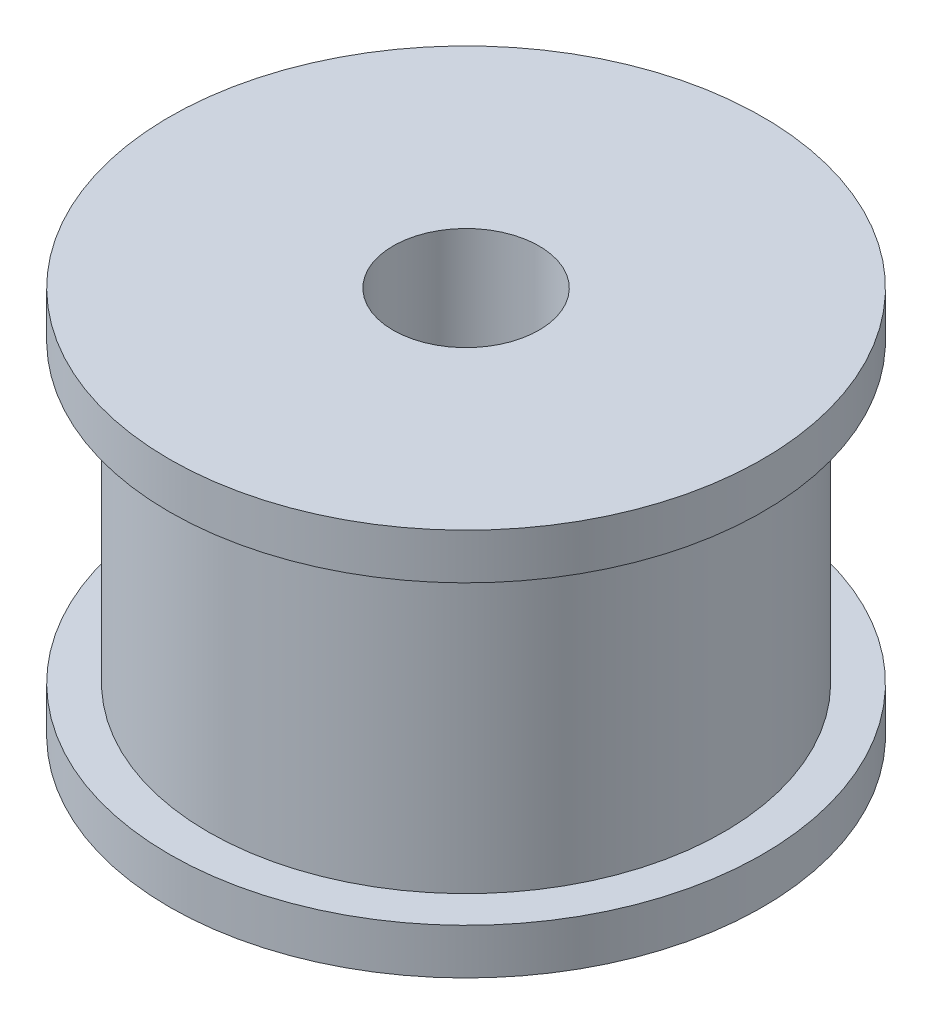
ISO-10303-21;
HEADER;
FILE_DESCRIPTION(('STEP AP214'),'2;1');
FILE_NAME('part.step','',(''),(''),'','','');
FILE_SCHEMA(('AUTOMOTIVE_DESIGN { 1 0 10303 214 1 1 1 1 }'));
ENDSEC;
DATA;
#1=APPLICATION_CONTEXT('core data for automotive mechanical design processes');
#2=APPLICATION_PROTOCOL_DEFINITION('international standard','automotive_design',2000,#1);
#3=PRODUCT_CONTEXT('',#1,'mechanical');
#4=PRODUCT('Part','Part','',(#3));
#5=PRODUCT_RELATED_PRODUCT_CATEGORY('part','',(#4));
#6=PRODUCT_DEFINITION_FORMATION('','',#4);
#7=PRODUCT_DEFINITION_CONTEXT('part definition',#1,'design');
#8=PRODUCT_DEFINITION('design','',#6,#7);
#9=PRODUCT_DEFINITION_SHAPE('','',#8);
#10=(LENGTH_UNIT() NAMED_UNIT(*) SI_UNIT(.MILLI.,.METRE.));
#11=(NAMED_UNIT(*) PLANE_ANGLE_UNIT() SI_UNIT($,.RADIAN.));
#12=(NAMED_UNIT(*) SI_UNIT($,.STERADIAN.) SOLID_ANGLE_UNIT());
#13=UNCERTAINTY_MEASURE_WITH_UNIT(LENGTH_MEASURE(1.E-05),#10,'distance_accuracy_value','');
#14=(GEOMETRIC_REPRESENTATION_CONTEXT(3) GLOBAL_UNCERTAINTY_ASSIGNED_CONTEXT((#13)) GLOBAL_UNIT_ASSIGNED_CONTEXT((#10,
#11,#12)) REPRESENTATION_CONTEXT('',''));
#15=CARTESIAN_POINT('',(0.,0.,0.));
#16=DIRECTION('',(0.,0.,1.));
#17=DIRECTION('',(1.,0.,0.));
#18=AXIS2_PLACEMENT_3D('',#15,#16,#17);
#19=CARTESIAN_POINT('',(-5.65,3.25,0.));
#20=DIRECTION('',(0.,-1.,0.));
#21=DIRECTION('',(0.,0.,-1.));
#22=AXIS2_PLACEMENT_3D('',#19,#20,#21);
#23=PLANE('',#22);
#24=CARTESIAN_POINT('',(0.,3.25,0.));
#25=DIRECTION('',(0.,1.,0.));
#26=DIRECTION('',(0.,0.,1.));
#27=AXIS2_PLACEMENT_3D('',#24,#25,#26);
#28=CIRCLE('',#27,5.65);
#29=CARTESIAN_POINT('',(0.,3.25,5.65));
#30=VERTEX_POINT('',#29);
#31=EDGE_CURVE('E54',#30,#30,#28,.T.);
#32=ORIENTED_EDGE('',*,*,#31,.T.);
#33=EDGE_LOOP('',(#32));
#34=FACE_BOUND('',#33,.T.);
#35=CARTESIAN_POINT('',(0.,3.25,0.));
#36=DIRECTION('',(0.,1.,0.));
#37=DIRECTION('',(0.,0.,1.));
#38=AXIS2_PLACEMENT_3D('',#35,#36,#37);
#39=CIRCLE('',#38,6.5);
#40=CARTESIAN_POINT('',(0.,3.25,6.5));
#41=VERTEX_POINT('',#40);
#42=EDGE_CURVE('E10',#41,#41,#39,.T.);
#43=ORIENTED_EDGE('',*,*,#42,.F.);
#44=EDGE_LOOP('',(#43));
#45=FACE_BOUND('',#44,.T.);
#46=ADVANCED_FACE('F32',(#34,#45),#23,.T.);
#47=CARTESIAN_POINT('',(0.,50.,0.));
#48=DIRECTION('',(0.,1.,0.));
#49=DIRECTION('',(0.,0.,1.));
#50=AXIS2_PLACEMENT_3D('',#47,#48,#49);
#51=CYLINDRICAL_SURFACE('',#50,6.5);
#52=ORIENTED_EDGE('',*,*,#42,.T.);
#53=EDGE_LOOP('',(#52));
#54=FACE_BOUND('',#53,.T.);
#55=CARTESIAN_POINT('',(0.,4.25,0.));
#56=DIRECTION('',(0.,1.,0.));
#57=DIRECTION('',(0.,0.,1.));
#58=AXIS2_PLACEMENT_3D('',#55,#56,#57);
#59=CIRCLE('',#58,6.5);
#60=CARTESIAN_POINT('',(0.,4.25,6.5));
#61=VERTEX_POINT('',#60);
#62=EDGE_CURVE('E39',#61,#61,#59,.T.);
#63=ORIENTED_EDGE('',*,*,#62,.F.);
#64=EDGE_LOOP('',(#63));
#65=FACE_BOUND('',#64,.T.);
#66=ADVANCED_FACE('F93',(#54,#65),#51,.T.);
#67=CARTESIAN_POINT('',(-6.5,4.25,0.));
#68=DIRECTION('',(0.,1.,0.));
#69=DIRECTION('',(0.,0.,1.));
#70=AXIS2_PLACEMENT_3D('',#67,#68,#69);
#71=PLANE('',#70);
#72=CARTESIAN_POINT('',(0.,4.25,0.));
#73=DIRECTION('',(0.,1.,0.));
#74=DIRECTION('',(0.,0.,1.));
#75=AXIS2_PLACEMENT_3D('',#72,#73,#74);
#76=CIRCLE('',#75,1.6);
#77=CARTESIAN_POINT('',(0.,4.25,1.6));
#78=VERTEX_POINT('',#77);
#79=EDGE_CURVE('E57',#78,#78,#76,.T.);
#80=ORIENTED_EDGE('',*,*,#79,.F.);
#81=EDGE_LOOP('',(#80));
#82=FACE_BOUND('',#81,.T.);
#83=ORIENTED_EDGE('',*,*,#62,.T.);
#84=EDGE_LOOP('',(#83));
#85=FACE_BOUND('',#84,.T.);
#86=ADVANCED_FACE('F70',(#82,#85),#71,.T.);
#87=CARTESIAN_POINT('',(-6.5,-4.25,0.));
#88=DIRECTION('',(0.,-1.,0.));
#89=DIRECTION('',(0.,0.,-1.));
#90=AXIS2_PLACEMENT_3D('',#87,#88,#89);
#91=PLANE('',#90);
#92=CARTESIAN_POINT('',(0.,-4.25,0.));
#93=DIRECTION('',(0.,-1.,0.));
#94=DIRECTION('',(0.,0.,-1.));
#95=AXIS2_PLACEMENT_3D('',#92,#93,#94);
#96=CIRCLE('',#95,1.6);
#97=CARTESIAN_POINT('',(0.,-4.25,-1.6));
#98=VERTEX_POINT('',#97);
#99=EDGE_CURVE('E35',#98,#98,#96,.T.);
#100=ORIENTED_EDGE('',*,*,#99,.F.);
#101=EDGE_LOOP('',(#100));
#102=FACE_BOUND('',#101,.T.);
#103=CARTESIAN_POINT('',(0.,-4.25,0.));
#104=DIRECTION('',(0.,1.,0.));
#105=DIRECTION('',(0.,0.,1.));
#106=AXIS2_PLACEMENT_3D('',#103,#104,#105);
#107=CIRCLE('',#106,6.5);
#108=CARTESIAN_POINT('',(0.,-4.25,6.5));
#109=VERTEX_POINT('',#108);
#110=EDGE_CURVE('E43',#109,#109,#107,.T.);
#111=ORIENTED_EDGE('',*,*,#110,.F.);
#112=EDGE_LOOP('',(#111));
#113=FACE_BOUND('',#112,.T.);
#114=ADVANCED_FACE('F66',(#102,#113),#91,.T.);
#115=CARTESIAN_POINT('',(0.,50.,0.));
#116=DIRECTION('',(0.,1.,0.));
#117=DIRECTION('',(0.,0.,1.));
#118=AXIS2_PLACEMENT_3D('',#115,#116,#117);
#119=CYLINDRICAL_SURFACE('',#118,6.5);
#120=ORIENTED_EDGE('',*,*,#110,.T.);
#121=EDGE_LOOP('',(#120));
#122=FACE_BOUND('',#121,.T.);
#123=CARTESIAN_POINT('',(0.,-3.25,0.));
#124=DIRECTION('',(0.,1.,0.));
#125=DIRECTION('',(0.,0.,1.));
#126=AXIS2_PLACEMENT_3D('',#123,#124,#125);
#127=CIRCLE('',#126,6.5);
#128=CARTESIAN_POINT('',(0.,-3.25,6.5));
#129=VERTEX_POINT('',#128);
#130=EDGE_CURVE('E48',#129,#129,#127,.T.);
#131=ORIENTED_EDGE('',*,*,#130,.F.);
#132=EDGE_LOOP('',(#131));
#133=FACE_BOUND('',#132,.T.);
#134=ADVANCED_FACE('F69',(#122,#133),#119,.T.);
#135=CARTESIAN_POINT('',(-5.65,-3.25,0.));
#136=DIRECTION('',(0.,1.,0.));
#137=DIRECTION('',(0.,0.,1.));
#138=AXIS2_PLACEMENT_3D('',#135,#136,#137);
#139=PLANE('',#138);
#140=ORIENTED_EDGE('',*,*,#130,.T.);
#141=EDGE_LOOP('',(#140));
#142=FACE_BOUND('',#141,.T.);
#143=CARTESIAN_POINT('',(0.,-3.25,0.));
#144=DIRECTION('',(0.,1.,0.));
#145=DIRECTION('',(0.,0.,1.));
#146=AXIS2_PLACEMENT_3D('',#143,#144,#145);
#147=CIRCLE('',#146,5.65);
#148=CARTESIAN_POINT('',(0.,-3.25,5.65));
#149=VERTEX_POINT('',#148);
#150=EDGE_CURVE('E51',#149,#149,#147,.T.);
#151=ORIENTED_EDGE('',*,*,#150,.F.);
#152=EDGE_LOOP('',(#151));
#153=FACE_BOUND('',#152,.T.);
#154=ADVANCED_FACE('F76',(#142,#153),#139,.T.);
#155=CARTESIAN_POINT('',(0.,50.,0.));
#156=DIRECTION('',(0.,1.,0.));
#157=DIRECTION('',(0.,0.,1.));
#158=AXIS2_PLACEMENT_3D('',#155,#156,#157);
#159=CYLINDRICAL_SURFACE('',#158,5.65);
#160=ORIENTED_EDGE('',*,*,#150,.T.);
#161=EDGE_LOOP('',(#160));
#162=FACE_BOUND('',#161,.T.);
#163=ORIENTED_EDGE('',*,*,#31,.F.);
#164=EDGE_LOOP('',(#163));
#165=FACE_BOUND('',#164,.T.);
#166=ADVANCED_FACE('F82',(#162,#165),#159,.T.);
#167=CARTESIAN_POINT('',(0.,-5.75,0.));
#168=DIRECTION('',(0.,1.,0.));
#169=DIRECTION('',(0.,0.,1.));
#170=AXIS2_PLACEMENT_3D('',#167,#168,#169);
#171=CYLINDRICAL_SURFACE('',#170,1.6);
#172=ORIENTED_EDGE('',*,*,#99,.T.);
#173=EDGE_LOOP('',(#172));
#174=FACE_BOUND('',#173,.T.);
#175=ORIENTED_EDGE('',*,*,#79,.T.);
#176=EDGE_LOOP('',(#175));
#177=FACE_BOUND('',#176,.T.);
#178=ADVANCED_FACE('F64',(#174,#177),#171,.F.);
#179=CLOSED_SHELL('',(#46,#66,#86,#114,#134,#154,#166,#178));
#180=MANIFOLD_SOLID_BREP('B2',#179);
#181=ADVANCED_BREP_SHAPE_REPRESENTATION('',(#18,#180),#14);
#182=SHAPE_DEFINITION_REPRESENTATION(#9,#181);
ENDSEC;
END-ISO-10303-21;
